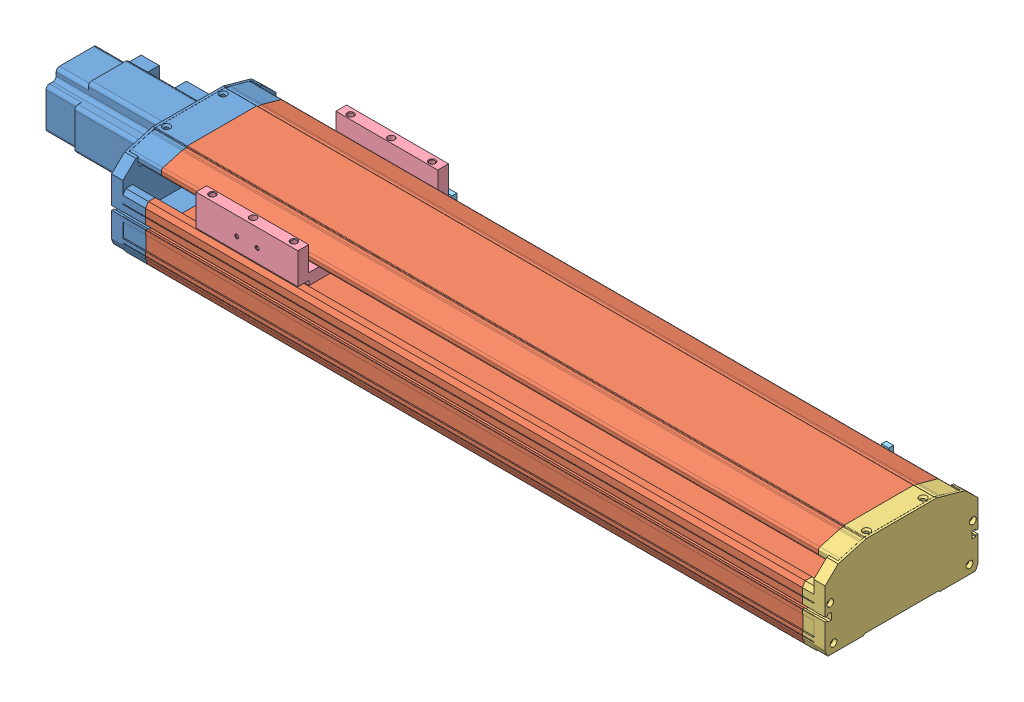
SolidWorks assembly TCD135-P-ZB-0.SLDASM, configuration 400 (file format 9000). Lengths in mm.
Overall size (728.41 78 148.4).
7 component instances, 5 part files, 19 mates.
Components (placement in the parent):
- TCD135-P-ZB-2-1: TCD135-P-ZB-2.sldprt [默认] at (178.5 0 0)
- TCD135-P-ZB-3-1: TCD135-P-ZB-3.SLDPRT [400] at (573.5 1.6 0) x (0 0 1) z (-1 0 0) size (135 73.5 580)
- TCD135-P-ZB-4-1: TCD135-P-ZB-4.SLDPRT [默认] at (444.5 0 0)
- TCD135-P-ZB-1-1: TCD135-P-ZB-1.sldprt [默认] at (82 35.5 0) x (0 0 -1) z (1 0 0)
- TCD135-P-ZB-5-1: TCD135-P-ZB-5.sldprt [默认] at (-61.7996 -3.6004 -11) x (0 0 -1) z (1 0 0)
- TCD135-P-ZB-5-2: TCD135-P-ZB-5.sldprt [默认] at (-26.7996 -3.6004 -11) x (0 0 -1) z (1 0 0)
- TCD135-P-ZB-5-3: TCD135-P-ZB-5.sldprt [默认] at (358.8004 -3.6004 -11) x (0 0 -1) z (1 0 0)
Mates (geometry in assembly coordinates):
- 重合26: coincident anti-aligned: plane of TCD135-P-ZB-3-1 through (573.5 1.3082 -63.6472) normal (1 0 0); plane of TCD135-P-ZB-4-1 through (573.5 75.4539 101.0619) normal (-1 0 0)
- 重合27: coincident aligned: plane of TCD135-P-ZB-3-1 through (-6.5 11.6 67) normal (0 0 1); plane of TCD135-P-ZB-4-1 through (444.5 17.6 67) normal (0 0 1)
- 重合28: coincident aligned: plane of TCD135-P-ZB-3-1 through (-6.5 73.5 30.5) normal (0 1 0); plane of TCD135-P-ZB-4-1 through (448.6 73.5 0) normal (0 1 0)
- 距离1: distance = 78 mm anti-aligned: plane of TCD135-P-ZB-1-1 through (82 78 61.75) normal (0 1 0); plane of TCD135-P-ZB-3-1 through (-6.5 0 34.1) normal (0 -1 0)
- 距离2: distance = 0.5 mm aligned: plane of TCD135-P-ZB-1-1 through (82 64.25 -66.5) normal (0 0 -1); plane of TCD135-P-ZB-3-1 through (-6.5 23.6 -67) normal (0 0 -1)
- LimitDistance1: limit distance = 73.5 mm aligned: plane of TCD135-P-ZB-1-1 through (37 62.25 0) normal (-1 0 0); plane of TCD135-P-ZB-2-1 through (-36.5 37 0) normal (-1 0 0)
- LimitDistance2: limit distance = 466.5 mm aligned: plane of TCD135-P-ZB-4-1 through (593.5 37 0) normal (1 0 0); plane of TCD135-P-ZB-1-1 through (127 62.25 0) normal (1 0 0)
- 重合29: coincident aligned: plane of TCD135-P-ZB-3-1 through (-6.5 73.5 30.5) normal (0 1 0); plane of TCD135-P-ZB-2-1 through (178.4 73.5 0) normal (0 1 0)
- 重合30: coincident aligned: plane of TCD135-P-ZB-3-1 through (-6.5 11.6 67) normal (0 0 1); plane of TCD135-P-ZB-2-1 through (178.5 17.6 67) normal (0 0 1)
- 重合31: coincident anti-aligned: plane of TCD135-P-ZB-3-1 through (-6.5 1.3082 -63.6472) normal (-1 0 0); plane of TCD135-P-ZB-2-1 through (-6.5 612.4415 -140.55) normal (1 0 0)
- 重合32: coincident anti-aligned: plane of TCD135-P-ZB-3-1 through (-6.5 27.5 -67.5) normal (0 0 -1); plane of TCD135-P-ZB-5-1 through (94.7 18.6 -67.5) normal (0 0 1)
- 重合33: coincident aligned: plane of TCD135-P-ZB-3-1 through (-6.5 27.8 -65.8) normal (0 1 0); plane of TCD135-P-ZB-5-1 through (71.1 27.8 -67.5) normal (0 1 0)
- 重合34: coincident anti-aligned: plane of TCD135-P-ZB-3-1 through (-6.5 27.5 -67.5) normal (0 0 -1); plane of TCD135-P-ZB-5-2 through (129.7 18.6 -67.5) normal (0 0 1)
- 重合35: coincident aligned: plane of TCD135-P-ZB-3-1 through (-6.5 27.8 -65.8) normal (0 1 0); plane of TCD135-P-ZB-5-2 through (106.1 27.8 -67.5) normal (0 1 0)
- 重合36: coincident anti-aligned: plane of TCD135-P-ZB-3-1 through (-6.5 27.5 -67.5) normal (0 0 -1); plane of TCD135-P-ZB-5-3 through (515.3 18.6 -67.5) normal (0 0 1)
- 重合37: coincident aligned: plane of TCD135-P-ZB-3-1 through (-6.5 27.8 -65.8) normal (0 1 0); plane of TCD135-P-ZB-5-3 through (491.7 27.8 -67.5) normal (0 1 0)
- 距离3: distance = 35 mm aligned: plane of TCD135-P-ZB-5-2 through (113.5 18.6 -67.5) normal (-1 0 0); plane of TCD135-P-ZB-5-1 through (78.5 18.6 -67.5) normal (-1 0 0)
- 距离4: distance = 115 mm aligned: plane of TCD135-P-ZB-5-1 through (78.5 18.6 -67.5) normal (-1 0 0); plane of TCD135-P-ZB-2-1 through (-36.5 37 0) normal (-1 0 0)
- 距离5: distance = 88 mm aligned: plane of TCD135-P-ZB-5-3 through (505.5 18.6 -67.5) normal (1 0 0); plane of TCD135-P-ZB-4-1 through (593.5 37 0) normal (1 0 0)
